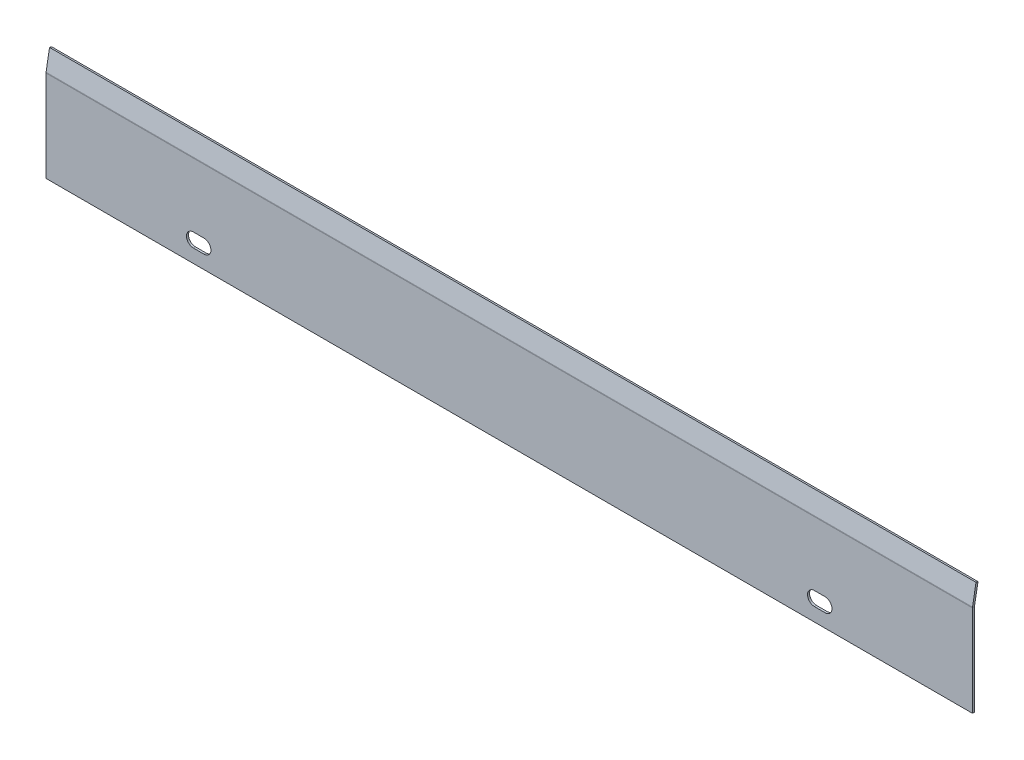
ISO-10303-21;
HEADER;
FILE_DESCRIPTION(('STEP AP214'),'2;1');
FILE_NAME('part.step','',(''),(''),'','','');
FILE_SCHEMA(('AUTOMOTIVE_DESIGN { 1 0 10303 214 1 1 1 1 }'));
ENDSEC;
DATA;
#1=APPLICATION_CONTEXT('core data for automotive mechanical design processes');
#2=APPLICATION_PROTOCOL_DEFINITION('international standard','automotive_design',2000,#1);
#3=PRODUCT_CONTEXT('',#1,'mechanical');
#4=PRODUCT('Part','Part','',(#3));
#5=PRODUCT_RELATED_PRODUCT_CATEGORY('part','',(#4));
#6=PRODUCT_DEFINITION_FORMATION('','',#4);
#7=PRODUCT_DEFINITION_CONTEXT('part definition',#1,'design');
#8=PRODUCT_DEFINITION('design','',#6,#7);
#9=PRODUCT_DEFINITION_SHAPE('','',#8);
#10=(LENGTH_UNIT() NAMED_UNIT(*) SI_UNIT(.MILLI.,.METRE.));
#11=(NAMED_UNIT(*) PLANE_ANGLE_UNIT() SI_UNIT($,.RADIAN.));
#12=(NAMED_UNIT(*) SI_UNIT($,.STERADIAN.) SOLID_ANGLE_UNIT());
#13=UNCERTAINTY_MEASURE_WITH_UNIT(LENGTH_MEASURE(1.E-05),#10,'distance_accuracy_value','');
#14=(GEOMETRIC_REPRESENTATION_CONTEXT(3) GLOBAL_UNCERTAINTY_ASSIGNED_CONTEXT((#13)) GLOBAL_UNIT_ASSIGNED_CONTEXT((#10,
#11,#12)) REPRESENTATION_CONTEXT('',''));
#15=CARTESIAN_POINT('',(0.,0.,0.));
#16=DIRECTION('',(0.,0.,1.));
#17=DIRECTION('',(1.,0.,0.));
#18=AXIS2_PLACEMENT_3D('',#15,#16,#17);
#19=CARTESIAN_POINT('',(227.500000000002,45.1723190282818,-0.0303844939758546));
#20=DIRECTION('',(1.00000000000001,0.,0.));
#21=DIRECTION('',(0.,0.,-1.));
#22=AXIS2_PLACEMENT_3D('',#19,#20,#21);
#23=PLANE('',#22);
#24=DIRECTION('',(0.,-0.173648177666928,-0.984807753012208));
#25=VECTOR('',#24,1.);
#26=CARTESIAN_POINT('',(227.500000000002,45.1723190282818,-0.0303844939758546));
#27=LINE('',#26,#25);
#28=CARTESIAN_POINT('',(227.500000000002,45.1723190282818,-0.0303844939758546));
#29=VERTEX_POINT('',#28);
#30=CARTESIAN_POINT('',(227.500000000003,44.9986708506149,-1.01519224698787));
#31=VERTEX_POINT('',#30);
#32=EDGE_CURVE('E317',#29,#31,#27,.T.);
#33=ORIENTED_EDGE('',*,*,#32,.F.);
#34=CARTESIAN_POINT('',(227.500000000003,44.8250226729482,-1.99999999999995));
#35=DIRECTION('',(1.00000000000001,0.,0.));
#36=DIRECTION('',(0.,0.,-1.));
#37=AXIS2_PLACEMENT_3D('',#34,#35,#36);
#38=CIRCLE('',#37,2.);
#39=CARTESIAN_POINT('',(227.500000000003,44.8250226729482,-2.77555756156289E-13));
#40=VERTEX_POINT('',#39);
#41=EDGE_CURVE('E260',#40,#29,#38,.F.);
#42=ORIENTED_EDGE('',*,*,#41,.F.);
#43=DIRECTION('',(0.,0.,1.));
#44=VECTOR('',#43,1.);
#45=CARTESIAN_POINT('',(227.500000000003,44.8250226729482,-1.00000000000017));
#46=LINE('',#45,#44);
#47=CARTESIAN_POINT('',(227.500000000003,44.8250226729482,-1.00000000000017));
#48=VERTEX_POINT('',#47);
#49=EDGE_CURVE('E314',#48,#40,#46,.T.);
#50=ORIENTED_EDGE('',*,*,#49,.F.);
#51=CARTESIAN_POINT('',(227.500000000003,44.8250226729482,-1.99999999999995));
#52=DIRECTION('',(1.00000000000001,0.,0.));
#53=DIRECTION('',(0.,0.,-1.));
#54=AXIS2_PLACEMENT_3D('',#51,#52,#53);
#55=CIRCLE('',#54,1.);
#56=EDGE_CURVE('E276',#48,#31,#55,.F.);
#57=ORIENTED_EDGE('',*,*,#56,.T.);
#58=EDGE_LOOP('',(#33,#42,#50,#57));
#59=FACE_BOUND('',#58,.T.);
#60=ADVANCED_FACE('F40',(#59),#23,.T.);
#61=CARTESIAN_POINT('',(227.500000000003,44.8250226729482,-1.00000000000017));
#62=DIRECTION('',(1.00000000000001,0.,0.));
#63=DIRECTION('',(0.,0.,-1.));
#64=AXIS2_PLACEMENT_3D('',#61,#62,#63);
#65=PLANE('',#64);
#66=DIRECTION('',(0.,0.984807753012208,-0.17364817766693));
#67=VECTOR('',#66,1.);
#68=CARTESIAN_POINT('',(227.500000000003,44.9999999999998,-3.33066907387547E-13));
#69=LINE('',#68,#67);
#70=CARTESIAN_POINT('',(227.500000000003,54.8480775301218,-1.73648177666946));
#71=VERTEX_POINT('',#70);
#72=EDGE_CURVE('E256',#29,#71,#69,.T.);
#73=ORIENTED_EDGE('',*,*,#72,.F.);
#74=ORIENTED_EDGE('',*,*,#32,.T.);
#75=DIRECTION('',(0.,0.984807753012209,-0.17364817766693));
#76=VECTOR('',#75,1.);
#77=CARTESIAN_POINT('',(227.500000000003,44.8263518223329,-0.984807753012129));
#78=LINE('',#77,#76);
#79=CARTESIAN_POINT('',(227.500000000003,54.6744293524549,-2.72128952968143));
#80=VERTEX_POINT('',#79);
#81=EDGE_CURVE('E250',#31,#80,#78,.T.);
#82=ORIENTED_EDGE('',*,*,#81,.T.);
#83=DIRECTION('',(0.,-0.173648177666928,-0.984807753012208));
#84=VECTOR('',#83,1.);
#85=CARTESIAN_POINT('',(227.500000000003,54.8480775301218,-1.73648177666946));
#86=LINE('',#85,#84);
#87=EDGE_CURVE('E253',#71,#80,#86,.T.);
#88=ORIENTED_EDGE('',*,*,#87,.F.);
#89=EDGE_LOOP('',(#73,#74,#82,#88));
#90=FACE_BOUND('',#89,.T.);
#91=ADVANCED_FACE('F362',(#90),#65,.T.);
#92=CARTESIAN_POINT('',(-227.500000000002,44.8250226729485,-3.33066907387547E-13));
#93=DIRECTION('',(-1.00000000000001,0.,0.));
#94=DIRECTION('',(0.,0.,1.));
#95=AXIS2_PLACEMENT_3D('',#92,#93,#94);
#96=PLANE('',#95);
#97=DIRECTION('',(0.,0.,-1.));
#98=VECTOR('',#97,1.);
#99=CARTESIAN_POINT('',(-227.500000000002,44.8250226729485,-3.33066907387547E-13));
#100=LINE('',#99,#98);
#101=CARTESIAN_POINT('',(-227.500000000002,44.8250226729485,-3.33066907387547E-13));
#102=VERTEX_POINT('',#101);
#103=CARTESIAN_POINT('',(-227.500000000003,44.8250226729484,-1.00000000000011));
#104=VERTEX_POINT('',#103);
#105=EDGE_CURVE('E311',#102,#104,#100,.T.);
#106=ORIENTED_EDGE('',*,*,#105,.F.);
#107=CARTESIAN_POINT('',(-227.500000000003,44.8250226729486,-1.99999999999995));
#108=DIRECTION('',(1.00000000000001,0.,0.));
#109=DIRECTION('',(0.,0.,-1.));
#110=AXIS2_PLACEMENT_3D('',#107,#108,#109);
#111=CIRCLE('',#110,2.);
#112=CARTESIAN_POINT('',(-227.500000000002,45.1723190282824,-0.0303844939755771));
#113=VERTEX_POINT('',#112);
#114=EDGE_CURVE('E230',#102,#113,#111,.F.);
#115=ORIENTED_EDGE('',*,*,#114,.T.);
#116=DIRECTION('',(0.,0.173648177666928,0.984807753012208));
#117=VECTOR('',#116,1.);
#118=CARTESIAN_POINT('',(-227.500000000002,44.9986708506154,-1.0151922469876));
#119=LINE('',#118,#117);
#120=CARTESIAN_POINT('',(-227.500000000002,44.9986708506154,-1.0151922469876));
#121=VERTEX_POINT('',#120);
#122=EDGE_CURVE('E308',#121,#113,#119,.T.);
#123=ORIENTED_EDGE('',*,*,#122,.F.);
#124=CARTESIAN_POINT('',(-227.500000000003,44.8250226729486,-1.99999999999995));
#125=DIRECTION('',(1.00000000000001,0.,0.));
#126=DIRECTION('',(0.,0.,-1.));
#127=AXIS2_PLACEMENT_3D('',#124,#125,#126);
#128=CIRCLE('',#127,1.);
#129=EDGE_CURVE('E246',#104,#121,#128,.F.);
#130=ORIENTED_EDGE('',*,*,#129,.F.);
#131=EDGE_LOOP('',(#106,#115,#123,#130));
#132=FACE_BOUND('',#131,.T.);
#133=ADVANCED_FACE('F367',(#132),#96,.T.);
#134=CARTESIAN_POINT('',(-227.500000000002,44.9986708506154,-1.0151922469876));
#135=DIRECTION('',(-1.00000000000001,0.,0.));
#136=DIRECTION('',(0.,0.,1.));
#137=AXIS2_PLACEMENT_3D('',#134,#135,#136);
#138=PLANE('',#137);
#139=DIRECTION('',(0.,1.,0.));
#140=VECTOR('',#139,1.);
#141=CARTESIAN_POINT('',(-227.500000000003,4.44089209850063E-13,0.));
#142=LINE('',#141,#140);
#143=CARTESIAN_POINT('',(-227.500000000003,4.44089209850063E-13,0.));
#144=VERTEX_POINT('',#143);
#145=EDGE_CURVE('E234',#144,#102,#142,.T.);
#146=ORIENTED_EDGE('',*,*,#145,.T.);
#147=ORIENTED_EDGE('',*,*,#105,.T.);
#148=DIRECTION('',(0.,1.,0.));
#149=VECTOR('',#148,1.);
#150=CARTESIAN_POINT('',(-227.500000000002,5.55111512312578E-13,-1.));
#151=LINE('',#150,#149);
#152=CARTESIAN_POINT('',(-227.500000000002,5.55111512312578E-13,-1.));
#153=VERTEX_POINT('',#152);
#154=EDGE_CURVE('E242',#153,#104,#151,.T.);
#155=ORIENTED_EDGE('',*,*,#154,.F.);
#156=DIRECTION('',(0.,0.,1.));
#157=VECTOR('',#156,1.);
#158=CARTESIAN_POINT('',(-227.500000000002,5.55111512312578E-13,-1.));
#159=LINE('',#158,#157);
#160=EDGE_CURVE('E238',#153,#144,#159,.T.);
#161=ORIENTED_EDGE('',*,*,#160,.T.);
#162=EDGE_LOOP('',(#146,#147,#155,#161));
#163=FACE_BOUND('',#162,.T.);
#164=ADVANCED_FACE('F410',(#163),#138,.T.);
#165=CARTESIAN_POINT('',(227.500000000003,44.8263518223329,-0.984807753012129));
#166=DIRECTION('',(0.,0.17364817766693,0.984807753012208));
#167=DIRECTION('',(0.,-0.984807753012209,0.17364817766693));
#168=AXIS2_PLACEMENT_3D('',#165,#166,#167);
#169=PLANE('',#168);
#170=DIRECTION('',(0.,0.984807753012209,-0.17364817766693));
#171=VECTOR('',#170,1.);
#172=CARTESIAN_POINT('',(-227.500000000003,44.8263518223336,-0.984807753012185));
#173=LINE('',#172,#171);
#174=CARTESIAN_POINT('',(-227.500000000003,54.6744293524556,-2.72128952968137));
#175=VERTEX_POINT('',#174);
#176=EDGE_CURVE('E209',#121,#175,#173,.T.);
#177=ORIENTED_EDGE('',*,*,#176,.T.);
#178=DIRECTION('',(-1.00000000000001,0.,0.));
#179=VECTOR('',#178,1.);
#180=CARTESIAN_POINT('',(227.500000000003,54.6744293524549,-2.72128952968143));
#181=LINE('',#180,#179);
#182=EDGE_CURVE('E305',#80,#175,#181,.T.);
#183=ORIENTED_EDGE('',*,*,#182,.F.);
#184=ORIENTED_EDGE('',*,*,#81,.F.);
#185=DIRECTION('',(-1.00000000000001,0.,0.));
#186=VECTOR('',#185,1.);
#187=CARTESIAN_POINT('',(227.500000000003,44.9986708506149,-1.01519224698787));
#188=LINE('',#187,#186);
#189=EDGE_CURVE('E280',#31,#121,#188,.T.);
#190=ORIENTED_EDGE('',*,*,#189,.T.);
#191=EDGE_LOOP('',(#177,#183,#184,#190));
#192=FACE_BOUND('',#191,.T.);
#193=ADVANCED_FACE('F402',(#192),#169,.F.);
#194=CARTESIAN_POINT('',(227.500000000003,54.8480775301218,-1.73648177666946));
#195=DIRECTION('',(0.,0.984807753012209,-0.173648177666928));
#196=DIRECTION('',(0.,0.173648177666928,0.984807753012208));
#197=AXIS2_PLACEMENT_3D('',#194,#195,#196);
#198=PLANE('',#197);
#199=DIRECTION('',(0.,-0.173648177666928,-0.984807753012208));
#200=VECTOR('',#199,1.);
#201=CARTESIAN_POINT('',(-227.500000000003,54.8480775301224,-1.73648177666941));
#202=LINE('',#201,#200);
#203=CARTESIAN_POINT('',(-227.500000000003,54.8480775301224,-1.73648177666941));
#204=VERTEX_POINT('',#203);
#205=EDGE_CURVE('E222',#204,#175,#202,.T.);
#206=ORIENTED_EDGE('',*,*,#205,.F.);
#207=DIRECTION('',(-1.00000000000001,0.,0.));
#208=VECTOR('',#207,1.);
#209=CARTESIAN_POINT('',(227.500000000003,54.8480775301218,-1.73648177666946));
#210=LINE('',#209,#208);
#211=EDGE_CURVE('E302',#71,#204,#210,.T.);
#212=ORIENTED_EDGE('',*,*,#211,.F.);
#213=ORIENTED_EDGE('',*,*,#87,.T.);
#214=ORIENTED_EDGE('',*,*,#182,.T.);
#215=EDGE_LOOP('',(#206,#212,#213,#214));
#216=FACE_BOUND('',#215,.T.);
#217=ADVANCED_FACE('F405',(#216),#198,.T.);
#218=CARTESIAN_POINT('',(227.500000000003,44.9999999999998,-3.33066907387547E-13));
#219=DIRECTION('',(0.,0.17364817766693,0.984807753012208));
#220=DIRECTION('',(0.,-0.984807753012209,0.17364817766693));
#221=AXIS2_PLACEMENT_3D('',#218,#219,#220);
#222=PLANE('',#221);
#223=DIRECTION('',(0.,0.984807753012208,-0.17364817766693));
#224=VECTOR('',#223,1.);
#225=CARTESIAN_POINT('',(-227.500000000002,45.0000000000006,0.));
#226=LINE('',#225,#224);
#227=EDGE_CURVE('E226',#113,#204,#226,.T.);
#228=ORIENTED_EDGE('',*,*,#227,.F.);
#229=DIRECTION('',(-1.00000000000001,0.,0.));
#230=VECTOR('',#229,1.);
#231=CARTESIAN_POINT('',(227.500000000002,45.1723190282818,-0.0303844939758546));
#232=LINE('',#231,#230);
#233=EDGE_CURVE('E298',#29,#113,#232,.T.);
#234=ORIENTED_EDGE('',*,*,#233,.F.);
#235=ORIENTED_EDGE('',*,*,#72,.T.);
#236=ORIENTED_EDGE('',*,*,#211,.T.);
#237=EDGE_LOOP('',(#228,#234,#235,#236));
#238=FACE_BOUND('',#237,.T.);
#239=ADVANCED_FACE('F376',(#238),#222,.T.);
#240=CARTESIAN_POINT('',(227.500000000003,44.8250226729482,-1.99999999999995));
#241=DIRECTION('',(-1.00000000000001,0.,0.));
#242=DIRECTION('',(0.,0.,1.));
#243=AXIS2_PLACEMENT_3D('',#240,#241,#242);
#244=CYLINDRICAL_SURFACE('',#243,2.);
#245=ORIENTED_EDGE('',*,*,#114,.F.);
#246=DIRECTION('',(-1.00000000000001,0.,0.));
#247=VECTOR('',#246,1.);
#248=CARTESIAN_POINT('',(227.500000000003,44.8250226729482,-2.77555756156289E-13));
#249=LINE('',#248,#247);
#250=EDGE_CURVE('E294',#40,#102,#249,.T.);
#251=ORIENTED_EDGE('',*,*,#250,.F.);
#252=ORIENTED_EDGE('',*,*,#41,.T.);
#253=ORIENTED_EDGE('',*,*,#233,.T.);
#254=EDGE_LOOP('',(#245,#251,#252,#253));
#255=FACE_BOUND('',#254,.T.);
#256=ADVANCED_FACE('F381',(#255),#244,.T.);
#257=CARTESIAN_POINT('',(227.500000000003,-1.11022302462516E-13,-6.66133814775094E-13));
#258=DIRECTION('',(0.,0.,1.));
#259=DIRECTION('',(1.00000000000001,0.,0.));
#260=AXIS2_PLACEMENT_3D('',#257,#258,#259);
#261=PLANE('',#260);
#262=CARTESIAN_POINT('',(149.900000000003,9.99999999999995,0.));
#263=DIRECTION('',(0.,0.,1.));
#264=DIRECTION('',(-1.00000000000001,0.,0.));
#265=AXIS2_PLACEMENT_3D('',#262,#263,#264);
#266=CIRCLE('',#265,3.4);
#267=CARTESIAN_POINT('',(149.900000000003,13.4000000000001,-1.66533453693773E-13));
#268=VERTEX_POINT('',#267);
#269=CARTESIAN_POINT('',(149.900000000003,6.59999999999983,-1.11022302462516E-13));
#270=VERTEX_POINT('',#269);
#271=EDGE_CURVE('E55',#268,#270,#266,.T.);
#272=ORIENTED_EDGE('',*,*,#271,.F.);
#273=DIRECTION('',(-1.00000000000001,0.,0.));
#274=VECTOR('',#273,1.);
#275=CARTESIAN_POINT('',(149.900000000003,13.4000000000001,-1.66533453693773E-13));
#276=LINE('',#275,#274);
#277=CARTESIAN_POINT('',(155.100000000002,13.4,0.));
#278=VERTEX_POINT('',#277);
#279=EDGE_CURVE('E174',#278,#268,#276,.T.);
#280=ORIENTED_EDGE('',*,*,#279,.F.);
#281=CARTESIAN_POINT('',(155.100000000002,9.9999999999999,-2.22044604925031E-13));
#282=DIRECTION('',(0.,0.,1.));
#283=DIRECTION('',(1.00000000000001,0.,0.));
#284=AXIS2_PLACEMENT_3D('',#281,#282,#283);
#285=CIRCLE('',#284,3.4);
#286=CARTESIAN_POINT('',(155.100000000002,6.59999999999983,-1.11022302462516E-13));
#287=VERTEX_POINT('',#286);
#288=EDGE_CURVE('E156',#287,#278,#285,.T.);
#289=ORIENTED_EDGE('',*,*,#288,.F.);
#290=DIRECTION('',(1.00000000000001,0.,0.));
#291=VECTOR('',#290,1.);
#292=CARTESIAN_POINT('',(149.900000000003,6.59999999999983,-1.11022302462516E-13));
#293=LINE('',#292,#291);
#294=EDGE_CURVE('E166',#270,#287,#293,.T.);
#295=ORIENTED_EDGE('',*,*,#294,.F.);
#296=EDGE_LOOP('',(#272,#280,#289,#295));
#297=FACE_BOUND('',#296,.T.);
#298=CARTESIAN_POINT('',(-155.100000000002,10.0000000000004,-5.55111512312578E-13));
#299=DIRECTION('',(0.,0.,1.));
#300=DIRECTION('',(-1.00000000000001,0.,0.));
#301=AXIS2_PLACEMENT_3D('',#298,#299,#300);
#302=CIRCLE('',#301,3.4);
#303=CARTESIAN_POINT('',(-155.100000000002,13.4000000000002,-3.88578058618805E-13));
#304=VERTEX_POINT('',#303);
#305=CARTESIAN_POINT('',(-155.100000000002,6.60000000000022,-6.10622663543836E-13));
#306=VERTEX_POINT('',#305);
#307=EDGE_CURVE('E186',#304,#306,#302,.T.);
#308=ORIENTED_EDGE('',*,*,#307,.F.);
#309=DIRECTION('',(-1.00000000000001,0.,0.));
#310=VECTOR('',#309,1.);
#311=CARTESIAN_POINT('',(-155.100000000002,13.4000000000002,-3.88578058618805E-13));
#312=LINE('',#311,#310);
#313=CARTESIAN_POINT('',(-149.900000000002,13.4,-4.9960036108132E-13));
#314=VERTEX_POINT('',#313);
#315=EDGE_CURVE('E201',#314,#304,#312,.T.);
#316=ORIENTED_EDGE('',*,*,#315,.F.);
#317=CARTESIAN_POINT('',(-149.900000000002,10.0000000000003,-4.9960036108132E-13));
#318=DIRECTION('',(0.,0.,1.));
#319=DIRECTION('',(1.00000000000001,0.,0.));
#320=AXIS2_PLACEMENT_3D('',#317,#318,#319);
#321=CIRCLE('',#320,3.4);
#322=CARTESIAN_POINT('',(-149.900000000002,6.60000000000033,-3.88578058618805E-13));
#323=VERTEX_POINT('',#322);
#324=EDGE_CURVE('E197',#323,#314,#321,.T.);
#325=ORIENTED_EDGE('',*,*,#324,.F.);
#326=DIRECTION('',(1.00000000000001,0.,0.));
#327=VECTOR('',#326,1.);
#328=CARTESIAN_POINT('',(-155.100000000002,6.60000000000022,-6.10622663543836E-13));
#329=LINE('',#328,#327);
#330=EDGE_CURVE('E193',#306,#323,#329,.T.);
#331=ORIENTED_EDGE('',*,*,#330,.F.);
#332=EDGE_LOOP('',(#308,#316,#325,#331));
#333=FACE_BOUND('',#332,.T.);
#334=ORIENTED_EDGE('',*,*,#145,.F.);
#335=DIRECTION('',(-1.00000000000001,0.,0.));
#336=VECTOR('',#335,1.);
#337=CARTESIAN_POINT('',(227.500000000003,-1.11022302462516E-13,-6.66133814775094E-13));
#338=LINE('',#337,#336);
#339=CARTESIAN_POINT('',(227.500000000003,-1.11022302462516E-13,-6.66133814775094E-13));
#340=VERTEX_POINT('',#339);
#341=EDGE_CURVE('E291',#340,#144,#338,.T.);
#342=ORIENTED_EDGE('',*,*,#341,.F.);
#343=DIRECTION('',(0.,1.,0.));
#344=VECTOR('',#343,1.);
#345=CARTESIAN_POINT('',(227.500000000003,-1.11022302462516E-13,-6.66133814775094E-13));
#346=LINE('',#345,#344);
#347=EDGE_CURVE('E264',#340,#40,#346,.T.);
#348=ORIENTED_EDGE('',*,*,#347,.T.);
#349=ORIENTED_EDGE('',*,*,#250,.T.);
#350=EDGE_LOOP('',(#334,#342,#348,#349));
#351=FACE_BOUND('',#350,.T.);
#352=ADVANCED_FACE('F171',(#297,#333,#351),#261,.T.);
#353=CARTESIAN_POINT('',(227.500000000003,-2.22044604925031E-13,-1.0000000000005));
#354=DIRECTION('',(0.,-1.,0.));
#355=DIRECTION('',(0.,0.,-1.));
#356=AXIS2_PLACEMENT_3D('',#353,#354,#355);
#357=PLANE('',#356);
#358=ORIENTED_EDGE('',*,*,#160,.F.);
#359=DIRECTION('',(-1.00000000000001,0.,0.));
#360=VECTOR('',#359,1.);
#361=CARTESIAN_POINT('',(227.500000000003,-2.22044604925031E-13,-1.0000000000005));
#362=LINE('',#361,#360);
#363=CARTESIAN_POINT('',(227.500000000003,-2.22044604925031E-13,-1.0000000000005));
#364=VERTEX_POINT('',#363);
#365=EDGE_CURVE('E288',#364,#153,#362,.T.);
#366=ORIENTED_EDGE('',*,*,#365,.F.);
#367=DIRECTION('',(0.,0.,1.));
#368=VECTOR('',#367,1.);
#369=CARTESIAN_POINT('',(227.500000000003,-2.22044604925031E-13,-1.0000000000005));
#370=LINE('',#369,#368);
#371=EDGE_CURVE('E268',#364,#340,#370,.T.);
#372=ORIENTED_EDGE('',*,*,#371,.T.);
#373=ORIENTED_EDGE('',*,*,#341,.T.);
#374=EDGE_LOOP('',(#358,#366,#372,#373));
#375=FACE_BOUND('',#374,.T.);
#376=ADVANCED_FACE('F390',(#375),#357,.T.);
#377=CARTESIAN_POINT('',(227.500000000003,-2.22044604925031E-13,-1.0000000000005));
#378=DIRECTION('',(0.,0.,1.));
#379=DIRECTION('',(1.00000000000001,0.,0.));
#380=AXIS2_PLACEMENT_3D('',#377,#378,#379);
#381=PLANE('',#380);
#382=DIRECTION('',(-1.00000000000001,0.,0.));
#383=VECTOR('',#382,1.);
#384=CARTESIAN_POINT('',(227.500000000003,13.4000000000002,-1.0000000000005));
#385=LINE('',#384,#383);
#386=CARTESIAN_POINT('',(155.100000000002,13.4000000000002,-1.00000000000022));
#387=VERTEX_POINT('',#386);
#388=CARTESIAN_POINT('',(149.900000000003,13.4,-1.00000000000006));
#389=VERTEX_POINT('',#388);
#390=EDGE_CURVE('E48',#387,#389,#385,.T.);
#391=ORIENTED_EDGE('',*,*,#390,.T.);
#392=CARTESIAN_POINT('',(149.900000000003,10.,-1.));
#393=DIRECTION('',(0.,0.,1.));
#394=DIRECTION('',(1.00000000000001,0.,0.));
#395=AXIS2_PLACEMENT_3D('',#392,#393,#394);
#396=CIRCLE('',#395,3.4);
#397=CARTESIAN_POINT('',(149.900000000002,6.59999999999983,-1.00000000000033));
#398=VERTEX_POINT('',#397);
#399=EDGE_CURVE('E11',#389,#398,#396,.T.);
#400=ORIENTED_EDGE('',*,*,#399,.T.);
#401=DIRECTION('',(1.00000000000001,0.,0.));
#402=VECTOR('',#401,1.);
#403=CARTESIAN_POINT('',(227.500000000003,6.59999999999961,-1.00000000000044));
#404=LINE('',#403,#402);
#405=CARTESIAN_POINT('',(155.100000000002,6.60000000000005,-1.00000000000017));
#406=VERTEX_POINT('',#405);
#407=EDGE_CURVE('E335',#398,#406,#404,.T.);
#408=ORIENTED_EDGE('',*,*,#407,.T.);
#409=CARTESIAN_POINT('',(155.100000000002,9.99999999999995,-1.00000000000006));
#410=DIRECTION('',(0.,0.,1.));
#411=DIRECTION('',(1.00000000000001,0.,0.));
#412=AXIS2_PLACEMENT_3D('',#409,#410,#411);
#413=CIRCLE('',#412,3.4);
#414=EDGE_CURVE('E159',#406,#387,#413,.T.);
#415=ORIENTED_EDGE('',*,*,#414,.T.);
#416=EDGE_LOOP('',(#391,#400,#408,#415));
#417=FACE_BOUND('',#416,.T.);
#418=DIRECTION('',(-1.00000000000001,0.,0.));
#419=VECTOR('',#418,1.);
#420=CARTESIAN_POINT('',(227.500000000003,13.4000000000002,-1.0000000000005));
#421=LINE('',#420,#419);
#422=CARTESIAN_POINT('',(-149.900000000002,13.4000000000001,-1.00000000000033));
#423=VERTEX_POINT('',#422);
#424=CARTESIAN_POINT('',(-155.100000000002,13.4000000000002,-1.00000000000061));
#425=VERTEX_POINT('',#424);
#426=EDGE_CURVE('E328',#423,#425,#421,.T.);
#427=ORIENTED_EDGE('',*,*,#426,.T.);
#428=CARTESIAN_POINT('',(-155.100000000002,10.0000000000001,-1.00000000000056));
#429=DIRECTION('',(0.,0.,1.));
#430=DIRECTION('',(1.00000000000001,0.,0.));
#431=AXIS2_PLACEMENT_3D('',#428,#429,#430);
#432=CIRCLE('',#431,3.4);
#433=CARTESIAN_POINT('',(-155.100000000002,6.60000000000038,-1.00000000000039));
#434=VERTEX_POINT('',#433);
#435=EDGE_CURVE('E331',#425,#434,#432,.T.);
#436=ORIENTED_EDGE('',*,*,#435,.T.);
#437=DIRECTION('',(1.00000000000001,0.,0.));
#438=VECTOR('',#437,1.);
#439=CARTESIAN_POINT('',(227.500000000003,6.59999999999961,-1.00000000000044));
#440=LINE('',#439,#438);
#441=CARTESIAN_POINT('',(-149.900000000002,6.60000000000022,-1.00000000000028));
#442=VERTEX_POINT('',#441);
#443=EDGE_CURVE('E320',#434,#442,#440,.T.);
#444=ORIENTED_EDGE('',*,*,#443,.T.);
#445=CARTESIAN_POINT('',(-149.900000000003,10.0000000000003,-1.00000000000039));
#446=DIRECTION('',(0.,0.,1.));
#447=DIRECTION('',(1.00000000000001,0.,0.));
#448=AXIS2_PLACEMENT_3D('',#445,#446,#447);
#449=CIRCLE('',#448,3.4);
#450=EDGE_CURVE('E324',#442,#423,#449,.T.);
#451=ORIENTED_EDGE('',*,*,#450,.T.);
#452=EDGE_LOOP('',(#427,#436,#444,#451));
#453=FACE_BOUND('',#452,.T.);
#454=ORIENTED_EDGE('',*,*,#154,.T.);
#455=DIRECTION('',(-1.00000000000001,0.,0.));
#456=VECTOR('',#455,1.);
#457=CARTESIAN_POINT('',(227.500000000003,44.8250226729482,-1.00000000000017));
#458=LINE('',#457,#456);
#459=EDGE_CURVE('E284',#48,#104,#458,.T.);
#460=ORIENTED_EDGE('',*,*,#459,.F.);
#461=DIRECTION('',(0.,1.,0.));
#462=VECTOR('',#461,1.);
#463=CARTESIAN_POINT('',(227.500000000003,-2.22044604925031E-13,-1.0000000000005));
#464=LINE('',#463,#462);
#465=EDGE_CURVE('E272',#364,#48,#464,.T.);
#466=ORIENTED_EDGE('',*,*,#465,.F.);
#467=ORIENTED_EDGE('',*,*,#365,.T.);
#468=EDGE_LOOP('',(#454,#460,#466,#467));
#469=FACE_BOUND('',#468,.T.);
#470=ADVANCED_FACE('F342',(#417,#453,#469),#381,.F.);
#471=CARTESIAN_POINT('',(227.500000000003,44.8250226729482,-1.99999999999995));
#472=DIRECTION('',(-1.00000000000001,0.,0.));
#473=DIRECTION('',(0.,0.,1.));
#474=AXIS2_PLACEMENT_3D('',#471,#472,#473);
#475=CYLINDRICAL_SURFACE('',#474,1.);
#476=ORIENTED_EDGE('',*,*,#129,.T.);
#477=ORIENTED_EDGE('',*,*,#189,.F.);
#478=ORIENTED_EDGE('',*,*,#56,.F.);
#479=ORIENTED_EDGE('',*,*,#459,.T.);
#480=EDGE_LOOP('',(#476,#477,#478,#479));
#481=FACE_BOUND('',#480,.T.);
#482=ADVANCED_FACE('F397',(#481),#475,.F.);
#483=CARTESIAN_POINT('',(227.500000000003,44.8250226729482,-1.99999999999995));
#484=DIRECTION('',(1.00000000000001,0.,0.));
#485=DIRECTION('',(0.,0.,-1.));
#486=AXIS2_PLACEMENT_3D('',#483,#484,#485);
#487=PLANE('',#486);
#488=ORIENTED_EDGE('',*,*,#465,.T.);
#489=ORIENTED_EDGE('',*,*,#49,.T.);
#490=ORIENTED_EDGE('',*,*,#347,.F.);
#491=ORIENTED_EDGE('',*,*,#371,.F.);
#492=EDGE_LOOP('',(#488,#489,#490,#491));
#493=FACE_BOUND('',#492,.T.);
#494=ADVANCED_FACE('F387',(#493),#487,.T.);
#495=CARTESIAN_POINT('',(-227.500000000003,44.8250226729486,-1.99999999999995));
#496=DIRECTION('',(1.00000000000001,0.,0.));
#497=DIRECTION('',(0.,0.,-1.));
#498=AXIS2_PLACEMENT_3D('',#495,#496,#497);
#499=PLANE('',#498);
#500=ORIENTED_EDGE('',*,*,#176,.F.);
#501=ORIENTED_EDGE('',*,*,#122,.T.);
#502=ORIENTED_EDGE('',*,*,#227,.T.);
#503=ORIENTED_EDGE('',*,*,#205,.T.);
#504=EDGE_LOOP('',(#500,#501,#502,#503));
#505=FACE_BOUND('',#504,.T.);
#506=ADVANCED_FACE('F407',(#505),#499,.F.);
#507=CARTESIAN_POINT('',(-155.100000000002,10.0000000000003,-2.72128952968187));
#508=DIRECTION('',(0.,0.,1.));
#509=DIRECTION('',(1.00000000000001,0.,0.));
#510=AXIS2_PLACEMENT_3D('',#507,#508,#509);
#511=CYLINDRICAL_SURFACE('',#510,3.4);
#512=DIRECTION('',(0.,0.,1.));
#513=VECTOR('',#512,1.);
#514=CARTESIAN_POINT('',(-155.100000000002,13.4000000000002,-2.72128952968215));
#515=LINE('',#514,#513);
#516=EDGE_CURVE('E206',#425,#304,#515,.T.);
#517=ORIENTED_EDGE('',*,*,#516,.T.);
#518=ORIENTED_EDGE('',*,*,#307,.T.);
#519=DIRECTION('',(0.,0.,1.));
#520=VECTOR('',#519,1.);
#521=CARTESIAN_POINT('',(-155.100000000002,6.60000000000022,-2.72128952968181));
#522=LINE('',#521,#520);
#523=EDGE_CURVE('E205',#434,#306,#522,.T.);
#524=ORIENTED_EDGE('',*,*,#523,.F.);
#525=ORIENTED_EDGE('',*,*,#435,.F.);
#526=EDGE_LOOP('',(#517,#518,#524,#525));
#527=FACE_BOUND('',#526,.T.);
#528=ADVANCED_FACE('F438',(#527),#511,.F.);
#529=CARTESIAN_POINT('',(-155.100000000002,13.4000000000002,-2.72128952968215));
#530=DIRECTION('',(0.,1.,0.));
#531=DIRECTION('',(0.,0.,1.));
#532=AXIS2_PLACEMENT_3D('',#529,#530,#531);
#533=PLANE('',#532);
#534=DIRECTION('',(0.,0.,1.));
#535=VECTOR('',#534,1.);
#536=CARTESIAN_POINT('',(-149.900000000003,13.4000000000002,-2.72128952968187));
#537=LINE('',#536,#535);
#538=EDGE_CURVE('E210',#423,#314,#537,.T.);
#539=ORIENTED_EDGE('',*,*,#538,.T.);
#540=ORIENTED_EDGE('',*,*,#315,.T.);
#541=ORIENTED_EDGE('',*,*,#516,.F.);
#542=ORIENTED_EDGE('',*,*,#426,.F.);
#543=EDGE_LOOP('',(#539,#540,#541,#542));
#544=FACE_BOUND('',#543,.T.);
#545=ADVANCED_FACE('F440',(#544),#533,.F.);
#546=CARTESIAN_POINT('',(-149.900000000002,10.0000000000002,-2.72128952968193));
#547=DIRECTION('',(0.,0.,1.));
#548=DIRECTION('',(1.00000000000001,0.,0.));
#549=AXIS2_PLACEMENT_3D('',#546,#547,#548);
#550=CYLINDRICAL_SURFACE('',#549,3.4);
#551=DIRECTION('',(0.,0.,1.));
#552=VECTOR('',#551,1.);
#553=CARTESIAN_POINT('',(-149.900000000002,6.60000000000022,-2.72128952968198));
#554=LINE('',#553,#552);
#555=EDGE_CURVE('E213',#442,#323,#554,.T.);
#556=ORIENTED_EDGE('',*,*,#555,.T.);
#557=ORIENTED_EDGE('',*,*,#324,.T.);
#558=ORIENTED_EDGE('',*,*,#538,.F.);
#559=ORIENTED_EDGE('',*,*,#450,.F.);
#560=EDGE_LOOP('',(#556,#557,#558,#559));
#561=FACE_BOUND('',#560,.T.);
#562=ADVANCED_FACE('F356',(#561),#550,.F.);
#563=CARTESIAN_POINT('',(-155.100000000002,6.60000000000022,-2.72128952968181));
#564=DIRECTION('',(0.,-1.,0.));
#565=DIRECTION('',(0.,0.,-1.));
#566=AXIS2_PLACEMENT_3D('',#563,#564,#565);
#567=PLANE('',#566);
#568=ORIENTED_EDGE('',*,*,#523,.T.);
#569=ORIENTED_EDGE('',*,*,#330,.T.);
#570=ORIENTED_EDGE('',*,*,#555,.F.);
#571=ORIENTED_EDGE('',*,*,#443,.F.);
#572=EDGE_LOOP('',(#568,#569,#570,#571));
#573=FACE_BOUND('',#572,.T.);
#574=ADVANCED_FACE('F349',(#573),#567,.F.);
#575=CARTESIAN_POINT('',(149.900000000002,10.,-2.72128952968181));
#576=DIRECTION('',(0.,0.,1.));
#577=DIRECTION('',(1.00000000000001,0.,0.));
#578=AXIS2_PLACEMENT_3D('',#575,#576,#577);
#579=CYLINDRICAL_SURFACE('',#578,3.4);
#580=DIRECTION('',(0.,0.,1.));
#581=VECTOR('',#580,1.);
#582=CARTESIAN_POINT('',(149.900000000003,13.3999999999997,-2.72128952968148));
#583=LINE('',#582,#581);
#584=EDGE_CURVE('E183',#389,#268,#583,.T.);
#585=ORIENTED_EDGE('',*,*,#584,.T.);
#586=ORIENTED_EDGE('',*,*,#271,.T.);
#587=DIRECTION('',(0.,0.,1.));
#588=VECTOR('',#587,1.);
#589=CARTESIAN_POINT('',(149.900000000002,6.59999999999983,-2.72128952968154));
#590=LINE('',#589,#588);
#591=EDGE_CURVE('E163',#398,#270,#590,.T.);
#592=ORIENTED_EDGE('',*,*,#591,.F.);
#593=ORIENTED_EDGE('',*,*,#399,.F.);
#594=EDGE_LOOP('',(#585,#586,#592,#593));
#595=FACE_BOUND('',#594,.T.);
#596=ADVANCED_FACE('F347',(#595),#579,.F.);
#597=CARTESIAN_POINT('',(149.900000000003,13.3999999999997,-2.72128952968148));
#598=DIRECTION('',(0.,1.,0.));
#599=DIRECTION('',(0.,0.,1.));
#600=AXIS2_PLACEMENT_3D('',#597,#598,#599);
#601=PLANE('',#600);
#602=DIRECTION('',(0.,0.,1.));
#603=VECTOR('',#602,1.);
#604=CARTESIAN_POINT('',(155.100000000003,13.4,-2.72128952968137));
#605=LINE('',#604,#603);
#606=EDGE_CURVE('E162',#387,#278,#605,.T.);
#607=ORIENTED_EDGE('',*,*,#606,.T.);
#608=ORIENTED_EDGE('',*,*,#279,.T.);
#609=ORIENTED_EDGE('',*,*,#584,.F.);
#610=ORIENTED_EDGE('',*,*,#390,.F.);
#611=EDGE_LOOP('',(#607,#608,#609,#610));
#612=FACE_BOUND('',#611,.T.);
#613=ADVANCED_FACE('F346',(#612),#601,.F.);
#614=CARTESIAN_POINT('',(155.100000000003,10.,-2.72128952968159));
#615=DIRECTION('',(0.,0.,1.));
#616=DIRECTION('',(1.00000000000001,0.,0.));
#617=AXIS2_PLACEMENT_3D('',#614,#615,#616);
#618=CYLINDRICAL_SURFACE('',#617,3.4);
#619=DIRECTION('',(0.,0.,1.));
#620=VECTOR('',#619,1.);
#621=CARTESIAN_POINT('',(155.100000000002,6.60000000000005,-2.7212895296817));
#622=LINE('',#621,#620);
#623=EDGE_CURVE('E63',#406,#287,#622,.T.);
#624=ORIENTED_EDGE('',*,*,#623,.T.);
#625=ORIENTED_EDGE('',*,*,#288,.T.);
#626=ORIENTED_EDGE('',*,*,#606,.F.);
#627=ORIENTED_EDGE('',*,*,#414,.F.);
#628=EDGE_LOOP('',(#624,#625,#626,#627));
#629=FACE_BOUND('',#628,.T.);
#630=ADVANCED_FACE('F153',(#629),#618,.F.);
#631=CARTESIAN_POINT('',(149.900000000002,6.59999999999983,-2.72128952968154));
#632=DIRECTION('',(0.,-1.,0.));
#633=DIRECTION('',(0.,0.,-1.));
#634=AXIS2_PLACEMENT_3D('',#631,#632,#633);
#635=PLANE('',#634);
#636=ORIENTED_EDGE('',*,*,#591,.T.);
#637=ORIENTED_EDGE('',*,*,#294,.T.);
#638=ORIENTED_EDGE('',*,*,#623,.F.);
#639=ORIENTED_EDGE('',*,*,#407,.F.);
#640=EDGE_LOOP('',(#636,#637,#638,#639));
#641=FACE_BOUND('',#640,.T.);
#642=ADVANCED_FACE('F167',(#641),#635,.F.);
#643=CLOSED_SHELL('',(#60,#91,#133,#164,#193,#217,#239,#256,#352,#376,#470,#482,#494,#506,#528,
#545,#562,#574,#596,#613,#630,#642));
#644=MANIFOLD_SOLID_BREP('B2',#643);
#645=ADVANCED_BREP_SHAPE_REPRESENTATION('',(#18,#644),#14);
#646=SHAPE_DEFINITION_REPRESENTATION(#9,#645);
ENDSEC;
END-ISO-10303-21;
